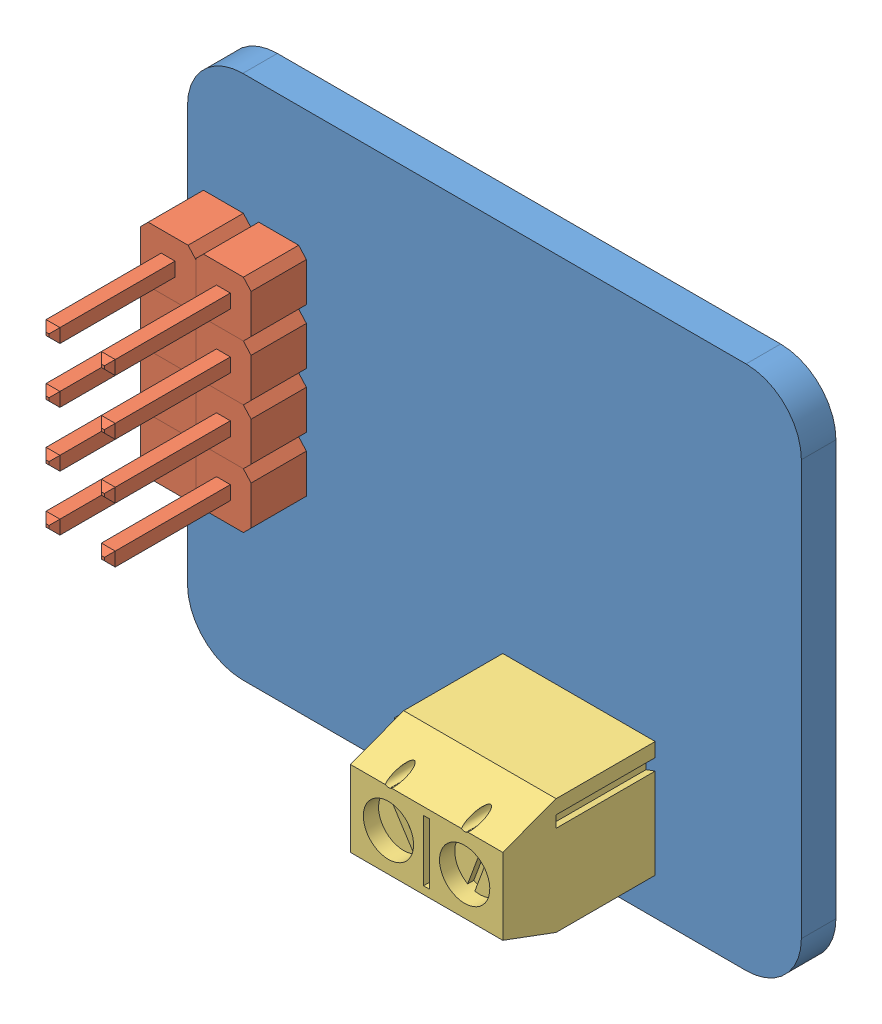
SolidWorks assembly ARDUINO AUDIO AMP MAX98306 987 with pin mods.SLDASM, configuration Default (file format 12000). Lengths in mm.
Overall size (28.19 24.13 11.07).
3 component instances, 3 part files, 10 mates.
Components (placement in the parent):
- ARDUINO AUDIO AMP MAX98306-1: ARDUINO AUDIO AMP MAX98306.SLDPRT [Default] at origin size (28.19 24.13 1.59)
- .100 Header-2: .100 Header.SLDPRT [2x4] at (-12.4471 5.2634 1.5875) size (5.08 10.16 11.07)
- Jack-2: Jack.SLDPRT [Default] at (3.8828 -7.6995 1.5875) x (1 0 0) z (0 -1 0) size (7.42 9.1 5.32)
Mates (geometry in assembly coordinates):
- Coincident1: coincident anti-aligned: plane of ARDUINO AUDIO AMP MAX98306-1 through (-11.557 -9.525 1.5875) normal (0 0 1); plane of .100 Header-1 through (10.4511 9.3113 1.5875) normal (0 0 -1)
- Coincident2: coincident anti-aligned: plane of ARDUINO AUDIO AMP MAX98306-1 through (-11.557 -9.525 1.5875) normal (0 0 1); plane of .100 Header-2 through (-12.4471 5.2634 1.5875) normal (0 0 -1)
- Coincident31: coincident anti-aligned: plane of ARDUINO AUDIO AMP MAX98306-1 through (-11.557 -9.525 1.5875) normal (0 0 1); plane of Jack-1 through (-7.339 -5.0552 1.5875) normal (0 0 -1)
- Coincident41: coincident anti-aligned: plane of ARDUINO AUDIO AMP MAX98306-1 through (-11.557 -9.525 1.5875) normal (0 0 1); plane of Jack-2 through (0.3828 -5.0395 1.5875) normal (0 0 -1)
- Coincident42: coincident aligned: plane of .100 Header-2 through (-13.7176 6.1598 4.1275) normal (-1 0 0); plane of .100 Header-4 through (-13.7176 6.1198 -2.54) normal (-1 0 0)
- Coincident43: coincident aligned: plane of .100 Header-2 through (-8.9902 -3.6466 4.1275) normal (0 -1 0); plane of .100 Header-4 through (-10.8241 -3.6466 -2.54) normal (0 -1 0)
- Coincident44: coincident anti-aligned: plane of ARDUINO AUDIO AMP MAX98306-1 through (-11.557 -9.525 0) normal (0 0 -1); plane of .100 Header-4 through (-9.9071 -2.3566 0) normal (0 0 1)
- Coincident45: coincident aligned: plane of .100 Header-1 through (-8.9725 10.5818 4.1275) normal (0 1 0); plane of .100 Header-3 through (-9.0125 10.5818 -2.54) normal (0 1 0)
- Coincident46: coincident aligned: plane of .100 Header-1 through (-11.1589 8.3944 4.1275) normal (-1 0 0); plane of .100 Header-3 through (-11.1589 10.2283 -2.54) normal (-1 0 0)
- Coincident47: coincident anti-aligned: plane of ARDUINO AUDIO AMP MAX98306-1 through (-11.557 -9.525 0) normal (0 0 -1); plane of .100 Header-3 through (-9.8689 9.3113 0) normal (0 0 1)
